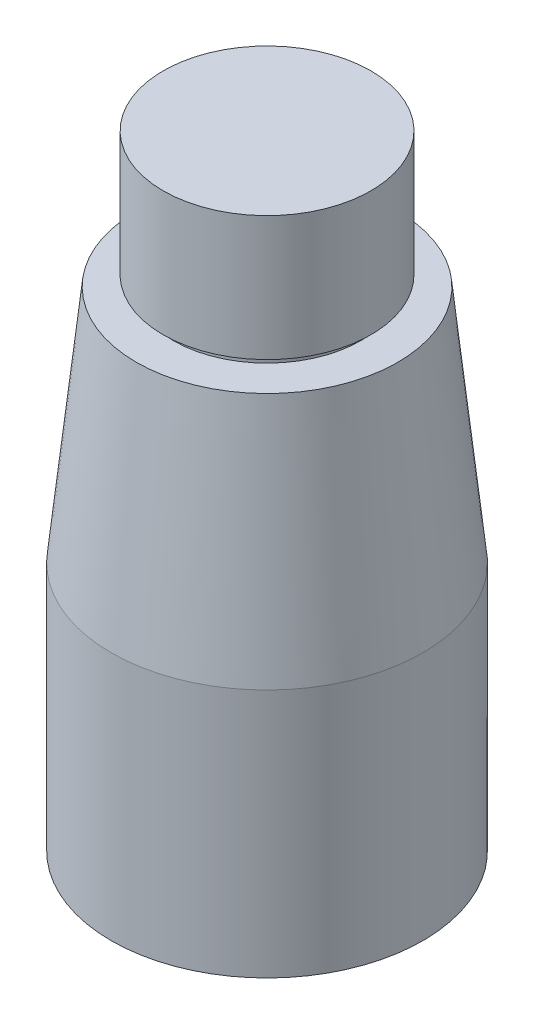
ISO-10303-21;
HEADER;
FILE_DESCRIPTION(('STEP AP214'),'2;1');
FILE_NAME('part.step','',(''),(''),'','','');
FILE_SCHEMA(('AUTOMOTIVE_DESIGN { 1 0 10303 214 1 1 1 1 }'));
ENDSEC;
DATA;
#1=APPLICATION_CONTEXT('core data for automotive mechanical design processes');
#2=APPLICATION_PROTOCOL_DEFINITION('international standard','automotive_design',2000,#1);
#3=PRODUCT_CONTEXT('',#1,'mechanical');
#4=PRODUCT('Part','Part','',(#3));
#5=PRODUCT_RELATED_PRODUCT_CATEGORY('part','',(#4));
#6=PRODUCT_DEFINITION_FORMATION('','',#4);
#7=PRODUCT_DEFINITION_CONTEXT('part definition',#1,'design');
#8=PRODUCT_DEFINITION('design','',#6,#7);
#9=PRODUCT_DEFINITION_SHAPE('','',#8);
#10=(LENGTH_UNIT() NAMED_UNIT(*) SI_UNIT(.MILLI.,.METRE.));
#11=(NAMED_UNIT(*) PLANE_ANGLE_UNIT() SI_UNIT($,.RADIAN.));
#12=(NAMED_UNIT(*) SI_UNIT($,.STERADIAN.) SOLID_ANGLE_UNIT());
#13=UNCERTAINTY_MEASURE_WITH_UNIT(LENGTH_MEASURE(1.E-05),#10,'distance_accuracy_value','');
#14=(GEOMETRIC_REPRESENTATION_CONTEXT(3) GLOBAL_UNCERTAINTY_ASSIGNED_CONTEXT((#13)) GLOBAL_UNIT_ASSIGNED_CONTEXT((#10,
#11,#12)) REPRESENTATION_CONTEXT('',''));
#15=CARTESIAN_POINT('',(0.,0.,0.));
#16=DIRECTION('',(0.,0.,1.));
#17=DIRECTION('',(1.,0.,0.));
#18=AXIS2_PLACEMENT_3D('',#15,#16,#17);
#19=CARTESIAN_POINT('',(0.,0.,0.));
#20=DIRECTION('',(0.,-1.,0.));
#21=DIRECTION('',(0.,0.,-1.));
#22=AXIS2_PLACEMENT_3D('',#19,#20,#21);
#23=PLANE('',#22);
#24=CARTESIAN_POINT('',(0.,0.,0.));
#25=DIRECTION('',(0.,1.,0.));
#26=DIRECTION('',(0.,0.,1.));
#27=AXIS2_PLACEMENT_3D('',#24,#25,#26);
#28=CIRCLE('',#27,15.);
#29=CARTESIAN_POINT('',(0.,0.,15.));
#30=VERTEX_POINT('',#29);
#31=EDGE_CURVE('E10',#30,#30,#28,.T.);
#32=ORIENTED_EDGE('',*,*,#31,.F.);
#33=EDGE_LOOP('',(#32));
#34=FACE_BOUND('',#33,.T.);
#35=ADVANCED_FACE('F31',(#34),#23,.T.);
#36=CARTESIAN_POINT('',(0.,85.1026449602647,0.));
#37=DIRECTION('',(0.,1.,0.));
#38=DIRECTION('',(0.,0.,1.));
#39=AXIS2_PLACEMENT_3D('',#36,#37,#38);
#40=CYLINDRICAL_SURFACE('',#39,15.);
#41=ORIENTED_EDGE('',*,*,#31,.T.);
#42=EDGE_LOOP('',(#41));
#43=FACE_BOUND('',#42,.T.);
#44=CARTESIAN_POINT('',(0.,24.,0.));
#45=DIRECTION('',(0.,1.,0.));
#46=DIRECTION('',(0.,0.,1.));
#47=AXIS2_PLACEMENT_3D('',#44,#45,#46);
#48=CIRCLE('',#47,15.);
#49=CARTESIAN_POINT('',(0.,24.,15.));
#50=VERTEX_POINT('',#49);
#51=EDGE_CURVE('E37',#50,#50,#48,.T.);
#52=ORIENTED_EDGE('',*,*,#51,.F.);
#53=EDGE_LOOP('',(#52));
#54=FACE_BOUND('',#53,.T.);
#55=ADVANCED_FACE('F76',(#43,#54),#40,.T.);
#56=CARTESIAN_POINT('',(0.,47.,0.));
#57=DIRECTION('',(0.,-1.,0.));
#58=DIRECTION('',(0.,0.,-1.));
#59=AXIS2_PLACEMENT_3D('',#56,#57,#58);
#60=CONICAL_SURFACE('',#59,12.5826025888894,0.10471975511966);
#61=ORIENTED_EDGE('',*,*,#51,.T.);
#62=EDGE_LOOP('',(#61));
#63=FACE_BOUND('',#62,.T.);
#64=CARTESIAN_POINT('',(0.,47.,0.));
#65=DIRECTION('',(0.,1.,0.));
#66=DIRECTION('',(0.,0.,1.));
#67=AXIS2_PLACEMENT_3D('',#64,#65,#66);
#68=CIRCLE('',#67,12.5826025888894);
#69=CARTESIAN_POINT('',(0.,47.,12.5826025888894));
#70=VERTEX_POINT('',#69);
#71=EDGE_CURVE('E41',#70,#70,#68,.T.);
#72=ORIENTED_EDGE('',*,*,#71,.F.);
#73=EDGE_LOOP('',(#72));
#74=FACE_BOUND('',#73,.T.);
#75=ADVANCED_FACE('F81',(#63,#74),#60,.T.);
#76=CARTESIAN_POINT('',(-12.5826025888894,47.,0.));
#77=DIRECTION('',(0.,1.,0.));
#78=DIRECTION('',(0.,0.,1.));
#79=AXIS2_PLACEMENT_3D('',#76,#77,#78);
#80=PLANE('',#79);
#81=ORIENTED_EDGE('',*,*,#71,.T.);
#82=EDGE_LOOP('',(#81));
#83=FACE_BOUND('',#82,.T.);
#84=CARTESIAN_POINT('',(0.,47.,0.));
#85=DIRECTION('',(0.,1.,0.));
#86=DIRECTION('',(0.,0.,1.));
#87=AXIS2_PLACEMENT_3D('',#84,#85,#86);
#88=CIRCLE('',#87,9.);
#89=CARTESIAN_POINT('',(0.,47.,9.));
#90=VERTEX_POINT('',#89);
#91=EDGE_CURVE('E45',#90,#90,#88,.T.);
#92=ORIENTED_EDGE('',*,*,#91,.F.);
#93=EDGE_LOOP('',(#92));
#94=FACE_BOUND('',#93,.T.);
#95=ADVANCED_FACE('F85',(#83,#94),#80,.T.);
#96=CARTESIAN_POINT('',(0.,85.1026449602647,0.));
#97=DIRECTION('',(0.,1.,0.));
#98=DIRECTION('',(0.,0.,1.));
#99=AXIS2_PLACEMENT_3D('',#96,#97,#98);
#100=CYLINDRICAL_SURFACE('',#99,9.);
#101=ORIENTED_EDGE('',*,*,#91,.T.);
#102=EDGE_LOOP('',(#101));
#103=FACE_BOUND('',#102,.T.);
#104=CARTESIAN_POINT('',(0.,48.,0.));
#105=DIRECTION('',(0.,1.,0.));
#106=DIRECTION('',(0.,0.,1.));
#107=AXIS2_PLACEMENT_3D('',#104,#105,#106);
#108=CIRCLE('',#107,9.);
#109=CARTESIAN_POINT('',(0.,48.,9.));
#110=VERTEX_POINT('',#109);
#111=EDGE_CURVE('E50',#110,#110,#108,.T.);
#112=ORIENTED_EDGE('',*,*,#111,.F.);
#113=EDGE_LOOP('',(#112));
#114=FACE_BOUND('',#113,.T.);
#115=ADVANCED_FACE('F72',(#103,#114),#100,.T.);
#116=CARTESIAN_POINT('',(-9.,48.,0.));
#117=DIRECTION('',(0.,-1.,0.));
#118=DIRECTION('',(0.,0.,-1.));
#119=AXIS2_PLACEMENT_3D('',#116,#117,#118);
#120=PLANE('',#119);
#121=ORIENTED_EDGE('',*,*,#111,.T.);
#122=EDGE_LOOP('',(#121));
#123=FACE_BOUND('',#122,.T.);
#124=CARTESIAN_POINT('',(0.,48.,0.));
#125=DIRECTION('',(0.,1.,0.));
#126=DIRECTION('',(0.,0.,1.));
#127=AXIS2_PLACEMENT_3D('',#124,#125,#126);
#128=CIRCLE('',#127,10.);
#129=CARTESIAN_POINT('',(0.,48.,10.));
#130=VERTEX_POINT('',#129);
#131=EDGE_CURVE('E53',#130,#130,#128,.T.);
#132=ORIENTED_EDGE('',*,*,#131,.F.);
#133=EDGE_LOOP('',(#132));
#134=FACE_BOUND('',#133,.T.);
#135=ADVANCED_FACE('F64',(#123,#134),#120,.T.);
#136=CARTESIAN_POINT('',(0.,85.1026449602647,0.));
#137=DIRECTION('',(0.,1.,0.));
#138=DIRECTION('',(0.,0.,1.));
#139=AXIS2_PLACEMENT_3D('',#136,#137,#138);
#140=CYLINDRICAL_SURFACE('',#139,10.);
#141=ORIENTED_EDGE('',*,*,#131,.T.);
#142=EDGE_LOOP('',(#141));
#143=FACE_BOUND('',#142,.T.);
#144=CARTESIAN_POINT('',(0.,60.,0.));
#145=DIRECTION('',(0.,1.,0.));
#146=DIRECTION('',(0.,0.,1.));
#147=AXIS2_PLACEMENT_3D('',#144,#145,#146);
#148=CIRCLE('',#147,10.);
#149=CARTESIAN_POINT('',(0.,60.,10.));
#150=VERTEX_POINT('',#149);
#151=EDGE_CURVE('E56',#150,#150,#148,.T.);
#152=ORIENTED_EDGE('',*,*,#151,.F.);
#153=EDGE_LOOP('',(#152));
#154=FACE_BOUND('',#153,.T.);
#155=ADVANCED_FACE('F62',(#143,#154),#140,.T.);
#156=CARTESIAN_POINT('',(-10.,60.,0.));
#157=DIRECTION('',(0.,1.,0.));
#158=DIRECTION('',(0.,0.,1.));
#159=AXIS2_PLACEMENT_3D('',#156,#157,#158);
#160=PLANE('',#159);
#161=ORIENTED_EDGE('',*,*,#151,.T.);
#162=EDGE_LOOP('',(#161));
#163=FACE_BOUND('',#162,.T.);
#164=ADVANCED_FACE('F60',(#163),#160,.T.);
#165=CLOSED_SHELL('',(#35,#55,#75,#95,#115,#135,#155,#164));
#166=MANIFOLD_SOLID_BREP('B2',#165);
#167=ADVANCED_BREP_SHAPE_REPRESENTATION('',(#18,#166),#14);
#168=SHAPE_DEFINITION_REPRESENTATION(#9,#167);
ENDSEC;
END-ISO-10303-21;
